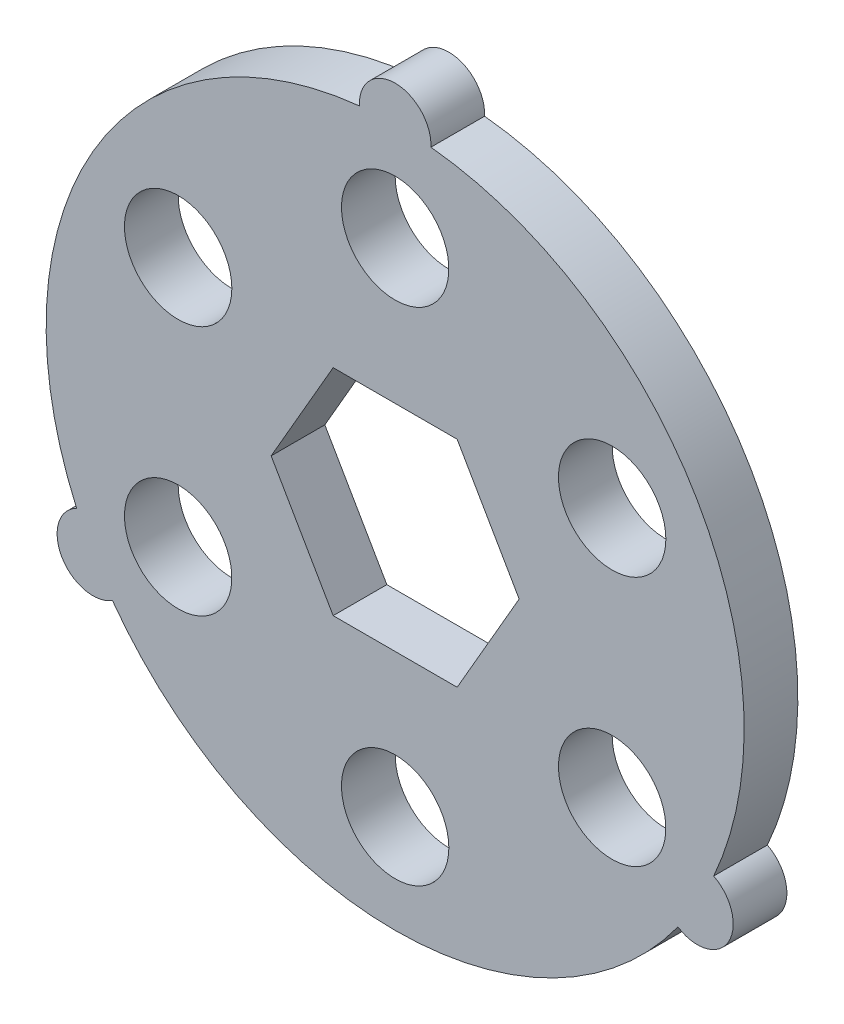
ISO-10303-21;
HEADER;
FILE_DESCRIPTION(('STEP AP214'),'2;1');
FILE_NAME('part.step','',(''),(''),'','','');
FILE_SCHEMA(('AUTOMOTIVE_DESIGN { 1 0 10303 214 1 1 1 1 }'));
ENDSEC;
DATA;
#1=APPLICATION_CONTEXT('core data for automotive mechanical design processes');
#2=APPLICATION_PROTOCOL_DEFINITION('international standard','automotive_design',2000,#1);
#3=PRODUCT_CONTEXT('',#1,'mechanical');
#4=PRODUCT('Part','Part','',(#3));
#5=PRODUCT_RELATED_PRODUCT_CATEGORY('part','',(#4));
#6=PRODUCT_DEFINITION_FORMATION('','',#4);
#7=PRODUCT_DEFINITION_CONTEXT('part definition',#1,'design');
#8=PRODUCT_DEFINITION('design','',#6,#7);
#9=PRODUCT_DEFINITION_SHAPE('','',#8);
#10=(LENGTH_UNIT() NAMED_UNIT(*) SI_UNIT(.MILLI.,.METRE.));
#11=(NAMED_UNIT(*) PLANE_ANGLE_UNIT() SI_UNIT($,.RADIAN.));
#12=(NAMED_UNIT(*) SI_UNIT($,.STERADIAN.) SOLID_ANGLE_UNIT());
#13=UNCERTAINTY_MEASURE_WITH_UNIT(LENGTH_MEASURE(1.E-05),#10,'distance_accuracy_value','');
#14=(GEOMETRIC_REPRESENTATION_CONTEXT(3) GLOBAL_UNCERTAINTY_ASSIGNED_CONTEXT((#13)) GLOBAL_UNIT_ASSIGNED_CONTEXT((#10,
#11,#12)) REPRESENTATION_CONTEXT('',''));
#15=CARTESIAN_POINT('',(0.,0.,0.));
#16=DIRECTION('',(0.,0.,1.));
#17=DIRECTION('',(1.,0.,0.));
#18=AXIS2_PLACEMENT_3D('',#15,#16,#17);
#19=CARTESIAN_POINT('',(0.,0.,0.75));
#20=DIRECTION('',(0.,0.,-1.));
#21=DIRECTION('',(-1.,0.,0.));
#22=AXIS2_PLACEMENT_3D('',#19,#20,#21);
#23=CYLINDRICAL_SURFACE('',#22,9.75);
#24=CARTESIAN_POINT('',(0.,0.,-0.75));
#25=DIRECTION('',(0.,0.,1.));
#26=DIRECTION('',(1.,0.,0.));
#27=AXIS2_PLACEMENT_3D('',#24,#25,#26);
#28=CIRCLE('',#27,9.75);
#29=CARTESIAN_POINT('',(-0.998684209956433,9.69871794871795,-0.75));
#30=VERTEX_POINT('',#29);
#31=CARTESIAN_POINT('',(-8.8986782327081,-3.98447307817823,-0.75));
#32=VERTEX_POINT('',#31);
#33=EDGE_CURVE('E126',#30,#32,#28,.T.);
#34=ORIENTED_EDGE('',*,*,#33,.T.);
#35=DIRECTION('',(0.,0.,1.));
#36=VECTOR('',#35,1.);
#37=CARTESIAN_POINT('',(-8.8986782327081,-3.98447307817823,0.));
#38=LINE('',#37,#36);
#39=CARTESIAN_POINT('',(-8.8986782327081,-3.98447307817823,0.75));
#40=VERTEX_POINT('',#39);
#41=EDGE_CURVE('E51',#32,#40,#38,.T.);
#42=ORIENTED_EDGE('',*,*,#41,.T.);
#43=CARTESIAN_POINT('',(0.,0.,0.75));
#44=DIRECTION('',(0.,0.,1.));
#45=DIRECTION('',(1.,0.,0.));
#46=AXIS2_PLACEMENT_3D('',#43,#44,#45);
#47=CIRCLE('',#46,9.75);
#48=CARTESIAN_POINT('',(-0.998684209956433,9.69871794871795,0.75));
#49=VERTEX_POINT('',#48);
#50=EDGE_CURVE('E233',#49,#40,#47,.T.);
#51=ORIENTED_EDGE('',*,*,#50,.F.);
#52=DIRECTION('',(0.,0.,1.));
#53=VECTOR('',#52,1.);
#54=CARTESIAN_POINT('',(-0.998684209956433,9.69871794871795,0.));
#55=LINE('',#54,#53);
#56=EDGE_CURVE('E235',#49,#30,#55,.F.);
#57=ORIENTED_EDGE('',*,*,#56,.T.);
#58=EDGE_LOOP('',(#34,#42,#51,#57));
#59=FACE_BOUND('',#58,.T.);
#60=ADVANCED_FACE('F29',(#59),#23,.T.);
#61=CARTESIAN_POINT('',(-7.89999402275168,-5.71424487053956,0.75));
#62=VERTEX_POINT('',#61);
#63=CARTESIAN_POINT('',(7.8999940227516,-5.71424487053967,0.75));
#64=VERTEX_POINT('',#63);
#65=EDGE_CURVE('E43',#62,#64,#47,.T.);
#66=ORIENTED_EDGE('',*,*,#65,.F.);
#67=DIRECTION('',(0.,0.,1.));
#68=VECTOR('',#67,1.);
#69=CARTESIAN_POINT('',(-7.89999402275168,-5.71424487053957,0.));
#70=LINE('',#69,#68);
#71=CARTESIAN_POINT('',(-7.89999402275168,-5.71424487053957,-0.75));
#72=VERTEX_POINT('',#71);
#73=EDGE_CURVE('E129',#62,#72,#70,.F.);
#74=ORIENTED_EDGE('',*,*,#73,.T.);
#75=CARTESIAN_POINT('',(7.8999940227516,-5.71424487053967,-0.75));
#76=VERTEX_POINT('',#75);
#77=EDGE_CURVE('E118',#72,#76,#28,.T.);
#78=ORIENTED_EDGE('',*,*,#77,.T.);
#79=DIRECTION('',(0.,0.,1.));
#80=VECTOR('',#79,1.);
#81=CARTESIAN_POINT('',(7.8999940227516,-5.71424487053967,0.));
#82=LINE('',#81,#80);
#83=EDGE_CURVE('E11',#76,#64,#82,.T.);
#84=ORIENTED_EDGE('',*,*,#83,.T.);
#85=EDGE_LOOP('',(#66,#74,#78,#84));
#86=FACE_BOUND('',#85,.T.);
#87=ADVANCED_FACE('F130',(#86),#23,.T.);
#88=CARTESIAN_POINT('',(0.,0.,0.75));
#89=DIRECTION('',(0.,0.,1.));
#90=DIRECTION('',(1.,0.,0.));
#91=AXIS2_PLACEMENT_3D('',#88,#89,#90);
#92=PLANE('',#91);
#93=ORIENTED_EDGE('',*,*,#50,.T.);
#94=CARTESIAN_POINT('',(-8.44374768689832,-4.87499999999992,0.75));
#95=DIRECTION('',(0.,0.,1.));
#96=DIRECTION('',(-0.499999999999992,0.866025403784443,0.));
#97=AXIS2_PLACEMENT_3D('',#94,#95,#96);
#98=CIRCLE('',#97,1.);
#99=EDGE_CURVE('E136',#40,#62,#98,.T.);
#100=ORIENTED_EDGE('',*,*,#99,.T.);
#101=ORIENTED_EDGE('',*,*,#65,.T.);
#102=CARTESIAN_POINT('',(8.44374768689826,-4.87500000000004,0.75));
#103=DIRECTION('',(0.,0.,1.));
#104=DIRECTION('',(-0.500000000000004,-0.866025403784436,0.));
#105=AXIS2_PLACEMENT_3D('',#102,#103,#104);
#106=CIRCLE('',#105,1.);
#107=CARTESIAN_POINT('',(8.89867823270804,-3.98447307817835,0.75));
#108=VERTEX_POINT('',#107);
#109=EDGE_CURVE('E141',#64,#108,#106,.T.);
#110=ORIENTED_EDGE('',*,*,#109,.T.);
#111=CARTESIAN_POINT('',(0.998684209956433,9.69871794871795,0.75));
#112=VERTEX_POINT('',#111);
#113=EDGE_CURVE('E232',#108,#112,#47,.T.);
#114=ORIENTED_EDGE('',*,*,#113,.T.);
#115=CARTESIAN_POINT('',(0.,9.75,0.75));
#116=DIRECTION('',(0.,0.,1.));
#117=DIRECTION('',(1.,0.,0.));
#118=AXIS2_PLACEMENT_3D('',#115,#116,#117);
#119=CIRCLE('',#118,1.);
#120=EDGE_CURVE('E145',#112,#49,#119,.T.);
#121=ORIENTED_EDGE('',*,*,#120,.T.);
#122=EDGE_LOOP('',(#93,#100,#101,#110,#114,#121));
#123=FACE_BOUND('',#122,.T.);
#124=CARTESIAN_POINT('',(0.,7.,0.75));
#125=DIRECTION('',(0.,0.,1.));
#126=DIRECTION('',(0.50000000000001,-0.866025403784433,0.));
#127=AXIS2_PLACEMENT_3D('',#124,#125,#126);
#128=CIRCLE('',#127,1.5);
#129=CARTESIAN_POINT('',(0.749999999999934,5.70096189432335,0.75));
#130=VERTEX_POINT('',#129);
#131=EDGE_CURVE('E151',#130,#130,#128,.T.);
#132=ORIENTED_EDGE('',*,*,#131,.F.);
#133=EDGE_LOOP('',(#132));
#134=FACE_BOUND('',#133,.T.);
#135=CARTESIAN_POINT('',(6.06217782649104,3.50000000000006,0.75));
#136=DIRECTION('',(0.,0.,1.));
#137=DIRECTION('',(-0.499999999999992,-0.866025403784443,0.));
#138=AXIS2_PLACEMENT_3D('',#135,#136,#137);
#139=CIRCLE('',#138,1.5);
#140=CARTESIAN_POINT('',(5.31217782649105,2.20096189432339,0.75));
#141=VERTEX_POINT('',#140);
#142=EDGE_CURVE('E157',#141,#141,#139,.T.);
#143=ORIENTED_EDGE('',*,*,#142,.F.);
#144=EDGE_LOOP('',(#143));
#145=FACE_BOUND('',#144,.T.);
#146=CARTESIAN_POINT('',(6.0621778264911,-3.49999999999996,0.75));
#147=DIRECTION('',(0.,0.,1.));
#148=DIRECTION('',(-1.,0.,0.));
#149=AXIS2_PLACEMENT_3D('',#146,#147,#148);
#150=CIRCLE('',#149,1.5);
#151=CARTESIAN_POINT('',(4.5621778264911,-3.49999999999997,0.75));
#152=VERTEX_POINT('',#151);
#153=EDGE_CURVE('E163',#152,#152,#150,.T.);
#154=ORIENTED_EDGE('',*,*,#153,.F.);
#155=EDGE_LOOP('',(#154));
#156=FACE_BOUND('',#155,.T.);
#157=CARTESIAN_POINT('',(0.,-7.,0.75));
#158=DIRECTION('',(0.,0.,1.));
#159=DIRECTION('',(-0.500000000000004,0.866025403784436,0.));
#160=AXIS2_PLACEMENT_3D('',#157,#158,#159);
#161=CIRCLE('',#160,1.5);
#162=CARTESIAN_POINT('',(-0.749999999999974,-5.70096189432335,0.75));
#163=VERTEX_POINT('',#162);
#164=EDGE_CURVE('E169',#163,#163,#161,.T.);
#165=ORIENTED_EDGE('',*,*,#164,.F.);
#166=EDGE_LOOP('',(#165));
#167=FACE_BOUND('',#166,.T.);
#168=CARTESIAN_POINT('',(-6.06217782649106,-3.50000000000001,0.75));
#169=DIRECTION('',(0.,0.,1.));
#170=DIRECTION('',(0.499999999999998,0.86602540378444,0.));
#171=AXIS2_PLACEMENT_3D('',#168,#169,#170);
#172=CIRCLE('',#171,1.5);
#173=CARTESIAN_POINT('',(-5.31217782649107,-2.20096189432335,0.75));
#174=VERTEX_POINT('',#173);
#175=EDGE_CURVE('E175',#174,#174,#172,.T.);
#176=ORIENTED_EDGE('',*,*,#175,.F.);
#177=EDGE_LOOP('',(#176));
#178=FACE_BOUND('',#177,.T.);
#179=CARTESIAN_POINT('',(-6.06217782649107,3.5,0.75));
#180=DIRECTION('',(0.,0.,1.));
#181=DIRECTION('',(1.,0.,0.));
#182=AXIS2_PLACEMENT_3D('',#179,#180,#181);
#183=CIRCLE('',#182,1.5);
#184=CARTESIAN_POINT('',(-4.56217782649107,3.5,0.75));
#185=VERTEX_POINT('',#184);
#186=EDGE_CURVE('E181',#185,#185,#183,.T.);
#187=ORIENTED_EDGE('',*,*,#186,.F.);
#188=EDGE_LOOP('',(#187));
#189=FACE_BOUND('',#188,.T.);
#190=DIRECTION('',(-0.5,0.866025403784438,0.));
#191=VECTOR('',#190,1.);
#192=CARTESIAN_POINT('',(3.46410161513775,0.,0.75));
#193=LINE('',#192,#191);
#194=CARTESIAN_POINT('',(3.46410161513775,0.,0.75));
#195=VERTEX_POINT('',#194);
#196=CARTESIAN_POINT('',(1.73205080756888,3.,0.75));
#197=VERTEX_POINT('',#196);
#198=EDGE_CURVE('E207',#195,#197,#193,.T.);
#199=ORIENTED_EDGE('',*,*,#198,.F.);
#200=DIRECTION('',(0.5,0.866025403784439,0.));
#201=VECTOR('',#200,1.);
#202=CARTESIAN_POINT('',(1.73205080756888,-3.,0.75));
#203=LINE('',#202,#201);
#204=CARTESIAN_POINT('',(1.73205080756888,-3.,0.75));
#205=VERTEX_POINT('',#204);
#206=EDGE_CURVE('E205',#205,#195,#203,.T.);
#207=ORIENTED_EDGE('',*,*,#206,.F.);
#208=DIRECTION('',(1.,0.,0.));
#209=VECTOR('',#208,1.);
#210=CARTESIAN_POINT('',(-1.73205080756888,-3.,0.75));
#211=LINE('',#210,#209);
#212=CARTESIAN_POINT('',(-1.73205080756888,-3.,0.75));
#213=VERTEX_POINT('',#212);
#214=EDGE_CURVE('E216',#213,#205,#211,.T.);
#215=ORIENTED_EDGE('',*,*,#214,.F.);
#216=DIRECTION('',(0.5,-0.866025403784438,0.));
#217=VECTOR('',#216,1.);
#218=CARTESIAN_POINT('',(-3.46410161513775,0.,0.75));
#219=LINE('',#218,#217);
#220=CARTESIAN_POINT('',(-3.46410161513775,0.,0.75));
#221=VERTEX_POINT('',#220);
#222=EDGE_CURVE('E213',#221,#213,#219,.T.);
#223=ORIENTED_EDGE('',*,*,#222,.F.);
#224=DIRECTION('',(-0.5,-0.866025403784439,0.));
#225=VECTOR('',#224,1.);
#226=CARTESIAN_POINT('',(-1.73205080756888,3.,0.75));
#227=LINE('',#226,#225);
#228=CARTESIAN_POINT('',(-1.73205080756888,3.,0.75));
#229=VERTEX_POINT('',#228);
#230=EDGE_CURVE('E211',#229,#221,#227,.T.);
#231=ORIENTED_EDGE('',*,*,#230,.F.);
#232=DIRECTION('',(-1.,0.,0.));
#233=VECTOR('',#232,1.);
#234=CARTESIAN_POINT('',(1.73205080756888,3.,0.75));
#235=LINE('',#234,#233);
#236=EDGE_CURVE('E209',#197,#229,#235,.T.);
#237=ORIENTED_EDGE('',*,*,#236,.F.);
#238=EDGE_LOOP('',(#199,#207,#215,#223,#231,#237));
#239=FACE_BOUND('',#238,.T.);
#240=ADVANCED_FACE('F248',(#123,#134,#145,#156,#167,#178,#189,#239),#92,.T.);
#241=CARTESIAN_POINT('',(0.,0.,-0.75));
#242=DIRECTION('',(0.,0.,1.));
#243=DIRECTION('',(1.,0.,0.));
#244=AXIS2_PLACEMENT_3D('',#241,#242,#243);
#245=PLANE('',#244);
#246=CARTESIAN_POINT('',(0.,7.,-0.75));
#247=DIRECTION('',(0.,0.,1.));
#248=DIRECTION('',(0.50000000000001,-0.866025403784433,0.));
#249=AXIS2_PLACEMENT_3D('',#246,#247,#248);
#250=CIRCLE('',#249,1.5);
#251=CARTESIAN_POINT('',(0.749999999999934,5.70096189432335,-0.75));
#252=VERTEX_POINT('',#251);
#253=EDGE_CURVE('E154',#252,#252,#250,.T.);
#254=ORIENTED_EDGE('',*,*,#253,.T.);
#255=EDGE_LOOP('',(#254));
#256=FACE_BOUND('',#255,.T.);
#257=CARTESIAN_POINT('',(6.06217782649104,3.50000000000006,-0.75));
#258=DIRECTION('',(0.,0.,1.));
#259=DIRECTION('',(-0.499999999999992,-0.866025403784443,0.));
#260=AXIS2_PLACEMENT_3D('',#257,#258,#259);
#261=CIRCLE('',#260,1.5);
#262=CARTESIAN_POINT('',(5.31217782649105,2.20096189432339,-0.75));
#263=VERTEX_POINT('',#262);
#264=EDGE_CURVE('E160',#263,#263,#261,.T.);
#265=ORIENTED_EDGE('',*,*,#264,.T.);
#266=EDGE_LOOP('',(#265));
#267=FACE_BOUND('',#266,.T.);
#268=CARTESIAN_POINT('',(6.0621778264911,-3.49999999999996,-0.75));
#269=DIRECTION('',(0.,0.,1.));
#270=DIRECTION('',(-1.,0.,0.));
#271=AXIS2_PLACEMENT_3D('',#268,#269,#270);
#272=CIRCLE('',#271,1.5);
#273=CARTESIAN_POINT('',(4.5621778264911,-3.49999999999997,-0.75));
#274=VERTEX_POINT('',#273);
#275=EDGE_CURVE('E166',#274,#274,#272,.T.);
#276=ORIENTED_EDGE('',*,*,#275,.T.);
#277=EDGE_LOOP('',(#276));
#278=FACE_BOUND('',#277,.T.);
#279=CARTESIAN_POINT('',(0.,-7.,-0.75));
#280=DIRECTION('',(0.,0.,1.));
#281=DIRECTION('',(-0.500000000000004,0.866025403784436,0.));
#282=AXIS2_PLACEMENT_3D('',#279,#280,#281);
#283=CIRCLE('',#282,1.5);
#284=CARTESIAN_POINT('',(-0.749999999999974,-5.70096189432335,-0.75));
#285=VERTEX_POINT('',#284);
#286=EDGE_CURVE('E172',#285,#285,#283,.T.);
#287=ORIENTED_EDGE('',*,*,#286,.T.);
#288=EDGE_LOOP('',(#287));
#289=FACE_BOUND('',#288,.T.);
#290=CARTESIAN_POINT('',(-6.06217782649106,-3.50000000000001,-0.75));
#291=DIRECTION('',(0.,0.,1.));
#292=DIRECTION('',(0.499999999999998,0.86602540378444,0.));
#293=AXIS2_PLACEMENT_3D('',#290,#291,#292);
#294=CIRCLE('',#293,1.5);
#295=CARTESIAN_POINT('',(-5.31217782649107,-2.20096189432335,-0.75));
#296=VERTEX_POINT('',#295);
#297=EDGE_CURVE('E178',#296,#296,#294,.T.);
#298=ORIENTED_EDGE('',*,*,#297,.T.);
#299=EDGE_LOOP('',(#298));
#300=FACE_BOUND('',#299,.T.);
#301=CARTESIAN_POINT('',(-6.06217782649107,3.5,-0.75));
#302=DIRECTION('',(0.,0.,1.));
#303=DIRECTION('',(1.,0.,0.));
#304=AXIS2_PLACEMENT_3D('',#301,#302,#303);
#305=CIRCLE('',#304,1.5);
#306=CARTESIAN_POINT('',(-4.56217782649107,3.5,-0.75));
#307=VERTEX_POINT('',#306);
#308=EDGE_CURVE('E184',#307,#307,#305,.T.);
#309=ORIENTED_EDGE('',*,*,#308,.T.);
#310=EDGE_LOOP('',(#309));
#311=FACE_BOUND('',#310,.T.);
#312=ORIENTED_EDGE('',*,*,#77,.F.);
#313=CARTESIAN_POINT('',(-8.44374768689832,-4.87499999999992,-0.75));
#314=DIRECTION('',(0.,0.,1.));
#315=DIRECTION('',(1.,0.,0.));
#316=AXIS2_PLACEMENT_3D('',#313,#314,#315);
#317=CIRCLE('',#316,1.);
#318=EDGE_CURVE('E122',#72,#32,#317,.F.);
#319=ORIENTED_EDGE('',*,*,#318,.T.);
#320=ORIENTED_EDGE('',*,*,#33,.F.);
#321=CARTESIAN_POINT('',(0.,9.75,-0.75));
#322=DIRECTION('',(0.,0.,1.));
#323=DIRECTION('',(1.,0.,0.));
#324=AXIS2_PLACEMENT_3D('',#321,#322,#323);
#325=CIRCLE('',#324,1.);
#326=CARTESIAN_POINT('',(0.998684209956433,9.69871794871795,-0.75));
#327=VERTEX_POINT('',#326);
#328=EDGE_CURVE('E148',#30,#327,#325,.F.);
#329=ORIENTED_EDGE('',*,*,#328,.T.);
#330=CARTESIAN_POINT('',(8.89867823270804,-3.98447307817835,-0.75));
#331=VERTEX_POINT('',#330);
#332=EDGE_CURVE('E127',#331,#327,#28,.T.);
#333=ORIENTED_EDGE('',*,*,#332,.F.);
#334=CARTESIAN_POINT('',(8.44374768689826,-4.87500000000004,-0.75));
#335=DIRECTION('',(0.,0.,1.));
#336=DIRECTION('',(1.,0.,0.));
#337=AXIS2_PLACEMENT_3D('',#334,#335,#336);
#338=CIRCLE('',#337,1.);
#339=EDGE_CURVE('E124',#331,#76,#338,.F.);
#340=ORIENTED_EDGE('',*,*,#339,.T.);
#341=EDGE_LOOP('',(#312,#319,#320,#329,#333,#340));
#342=FACE_BOUND('',#341,.T.);
#343=DIRECTION('',(0.5,0.866025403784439,0.));
#344=VECTOR('',#343,1.);
#345=CARTESIAN_POINT('',(1.73205080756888,-3.,-0.75));
#346=LINE('',#345,#344);
#347=CARTESIAN_POINT('',(1.73205080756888,-3.,-0.75));
#348=VERTEX_POINT('',#347);
#349=CARTESIAN_POINT('',(3.46410161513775,0.,-0.75));
#350=VERTEX_POINT('',#349);
#351=EDGE_CURVE('E187',#348,#350,#346,.T.);
#352=ORIENTED_EDGE('',*,*,#351,.T.);
#353=DIRECTION('',(-0.5,0.866025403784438,0.));
#354=VECTOR('',#353,1.);
#355=CARTESIAN_POINT('',(3.46410161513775,0.,-0.75));
#356=LINE('',#355,#354);
#357=CARTESIAN_POINT('',(1.73205080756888,3.,-0.75));
#358=VERTEX_POINT('',#357);
#359=EDGE_CURVE('E190',#350,#358,#356,.T.);
#360=ORIENTED_EDGE('',*,*,#359,.T.);
#361=DIRECTION('',(-1.,0.,0.));
#362=VECTOR('',#361,1.);
#363=CARTESIAN_POINT('',(1.73205080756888,3.,-0.75));
#364=LINE('',#363,#362);
#365=CARTESIAN_POINT('',(-1.73205080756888,3.,-0.75));
#366=VERTEX_POINT('',#365);
#367=EDGE_CURVE('E193',#358,#366,#364,.T.);
#368=ORIENTED_EDGE('',*,*,#367,.T.);
#369=DIRECTION('',(-0.5,-0.866025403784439,0.));
#370=VECTOR('',#369,1.);
#371=CARTESIAN_POINT('',(-1.73205080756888,3.,-0.75));
#372=LINE('',#371,#370);
#373=CARTESIAN_POINT('',(-3.46410161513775,0.,-0.75));
#374=VERTEX_POINT('',#373);
#375=EDGE_CURVE('E196',#366,#374,#372,.T.);
#376=ORIENTED_EDGE('',*,*,#375,.T.);
#377=DIRECTION('',(0.5,-0.866025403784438,0.));
#378=VECTOR('',#377,1.);
#379=CARTESIAN_POINT('',(-3.46410161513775,0.,-0.75));
#380=LINE('',#379,#378);
#381=CARTESIAN_POINT('',(-1.73205080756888,-3.,-0.75));
#382=VERTEX_POINT('',#381);
#383=EDGE_CURVE('E199',#374,#382,#380,.T.);
#384=ORIENTED_EDGE('',*,*,#383,.T.);
#385=DIRECTION('',(1.,0.,0.));
#386=VECTOR('',#385,1.);
#387=CARTESIAN_POINT('',(-1.73205080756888,-3.,-0.75));
#388=LINE('',#387,#386);
#389=EDGE_CURVE('E202',#382,#348,#388,.T.);
#390=ORIENTED_EDGE('',*,*,#389,.T.);
#391=EDGE_LOOP('',(#352,#360,#368,#376,#384,#390));
#392=FACE_BOUND('',#391,.T.);
#393=ADVANCED_FACE('F119',(#256,#267,#278,#289,#300,#311,#342,#392),#245,.F.);
#394=ORIENTED_EDGE('',*,*,#113,.F.);
#395=DIRECTION('',(0.,0.,1.));
#396=VECTOR('',#395,1.);
#397=CARTESIAN_POINT('',(8.89867823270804,-3.98447307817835,0.));
#398=LINE('',#397,#396);
#399=EDGE_CURVE('E37',#108,#331,#398,.F.);
#400=ORIENTED_EDGE('',*,*,#399,.T.);
#401=ORIENTED_EDGE('',*,*,#332,.T.);
#402=DIRECTION('',(0.,0.,1.));
#403=VECTOR('',#402,1.);
#404=CARTESIAN_POINT('',(0.998684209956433,9.69871794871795,0.));
#405=LINE('',#404,#403);
#406=EDGE_CURVE('E238',#327,#112,#405,.T.);
#407=ORIENTED_EDGE('',*,*,#406,.T.);
#408=EDGE_LOOP('',(#394,#400,#401,#407));
#409=FACE_BOUND('',#408,.T.);
#410=ADVANCED_FACE('F31',(#409),#23,.T.);
#411=CARTESIAN_POINT('',(1.73205080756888,-3.,0.75));
#412=DIRECTION('',(-0.866025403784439,0.5,0.));
#413=DIRECTION('',(-0.5,-0.866025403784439,0.));
#414=AXIS2_PLACEMENT_3D('',#411,#412,#413);
#415=PLANE('',#414);
#416=ORIENTED_EDGE('',*,*,#351,.F.);
#417=DIRECTION('',(0.,0.,-1.));
#418=VECTOR('',#417,1.);
#419=CARTESIAN_POINT('',(1.73205080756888,-3.,0.75));
#420=LINE('',#419,#418);
#421=EDGE_CURVE('E218',#205,#348,#420,.T.);
#422=ORIENTED_EDGE('',*,*,#421,.F.);
#423=ORIENTED_EDGE('',*,*,#206,.T.);
#424=DIRECTION('',(0.,0.,-1.));
#425=VECTOR('',#424,1.);
#426=CARTESIAN_POINT('',(3.46410161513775,0.,0.75));
#427=LINE('',#426,#425);
#428=EDGE_CURVE('E229',#195,#350,#427,.T.);
#429=ORIENTED_EDGE('',*,*,#428,.T.);
#430=EDGE_LOOP('',(#416,#422,#423,#429));
#431=FACE_BOUND('',#430,.T.);
#432=ADVANCED_FACE('F271',(#431),#415,.T.);
#433=CARTESIAN_POINT('',(3.46410161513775,0.,0.75));
#434=DIRECTION('',(-0.866025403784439,-0.5,0.));
#435=DIRECTION('',(0.5,-0.866025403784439,0.));
#436=AXIS2_PLACEMENT_3D('',#433,#434,#435);
#437=PLANE('',#436);
#438=ORIENTED_EDGE('',*,*,#359,.F.);
#439=ORIENTED_EDGE('',*,*,#428,.F.);
#440=ORIENTED_EDGE('',*,*,#198,.T.);
#441=DIRECTION('',(0.,0.,-1.));
#442=VECTOR('',#441,1.);
#443=CARTESIAN_POINT('',(1.73205080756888,3.,0.75));
#444=LINE('',#443,#442);
#445=EDGE_CURVE('E227',#197,#358,#444,.T.);
#446=ORIENTED_EDGE('',*,*,#445,.T.);
#447=EDGE_LOOP('',(#438,#439,#440,#446));
#448=FACE_BOUND('',#447,.T.);
#449=ADVANCED_FACE('F276',(#448),#437,.T.);
#450=CARTESIAN_POINT('',(1.73205080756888,3.,0.75));
#451=DIRECTION('',(0.,-1.,0.));
#452=DIRECTION('',(1.,0.,0.));
#453=AXIS2_PLACEMENT_3D('',#450,#451,#452);
#454=PLANE('',#453);
#455=ORIENTED_EDGE('',*,*,#367,.F.);
#456=ORIENTED_EDGE('',*,*,#445,.F.);
#457=ORIENTED_EDGE('',*,*,#236,.T.);
#458=DIRECTION('',(0.,0.,-1.));
#459=VECTOR('',#458,1.);
#460=CARTESIAN_POINT('',(-1.73205080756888,3.,0.75));
#461=LINE('',#460,#459);
#462=EDGE_CURVE('E225',#229,#366,#461,.T.);
#463=ORIENTED_EDGE('',*,*,#462,.T.);
#464=EDGE_LOOP('',(#455,#456,#457,#463));
#465=FACE_BOUND('',#464,.T.);
#466=ADVANCED_FACE('F288',(#465),#454,.T.);
#467=CARTESIAN_POINT('',(-1.73205080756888,3.,0.75));
#468=DIRECTION('',(0.866025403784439,-0.5,0.));
#469=DIRECTION('',(0.5,0.866025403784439,0.));
#470=AXIS2_PLACEMENT_3D('',#467,#468,#469);
#471=PLANE('',#470);
#472=ORIENTED_EDGE('',*,*,#375,.F.);
#473=ORIENTED_EDGE('',*,*,#462,.F.);
#474=ORIENTED_EDGE('',*,*,#230,.T.);
#475=DIRECTION('',(0.,0.,-1.));
#476=VECTOR('',#475,1.);
#477=CARTESIAN_POINT('',(-3.46410161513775,0.,0.75));
#478=LINE('',#477,#476);
#479=EDGE_CURVE('E223',#221,#374,#478,.T.);
#480=ORIENTED_EDGE('',*,*,#479,.T.);
#481=EDGE_LOOP('',(#472,#473,#474,#480));
#482=FACE_BOUND('',#481,.T.);
#483=ADVANCED_FACE('F292',(#482),#471,.T.);
#484=CARTESIAN_POINT('',(-3.46410161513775,0.,0.75));
#485=DIRECTION('',(0.866025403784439,0.5,0.));
#486=DIRECTION('',(-0.5,0.866025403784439,0.));
#487=AXIS2_PLACEMENT_3D('',#484,#485,#486);
#488=PLANE('',#487);
#489=ORIENTED_EDGE('',*,*,#383,.F.);
#490=ORIENTED_EDGE('',*,*,#479,.F.);
#491=ORIENTED_EDGE('',*,*,#222,.T.);
#492=DIRECTION('',(0.,0.,-1.));
#493=VECTOR('',#492,1.);
#494=CARTESIAN_POINT('',(-1.73205080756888,-3.,0.75));
#495=LINE('',#494,#493);
#496=EDGE_CURVE('E221',#213,#382,#495,.T.);
#497=ORIENTED_EDGE('',*,*,#496,.T.);
#498=EDGE_LOOP('',(#489,#490,#491,#497));
#499=FACE_BOUND('',#498,.T.);
#500=ADVANCED_FACE('F296',(#499),#488,.T.);
#501=CARTESIAN_POINT('',(-1.73205080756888,-3.,0.75));
#502=DIRECTION('',(0.,1.,0.));
#503=DIRECTION('',(-1.,0.,0.));
#504=AXIS2_PLACEMENT_3D('',#501,#502,#503);
#505=PLANE('',#504);
#506=ORIENTED_EDGE('',*,*,#389,.F.);
#507=ORIENTED_EDGE('',*,*,#496,.F.);
#508=ORIENTED_EDGE('',*,*,#214,.T.);
#509=ORIENTED_EDGE('',*,*,#421,.T.);
#510=EDGE_LOOP('',(#506,#507,#508,#509));
#511=FACE_BOUND('',#510,.T.);
#512=ADVANCED_FACE('F300',(#511),#505,.T.);
#513=CARTESIAN_POINT('',(-6.06217782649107,3.5,-0.75));
#514=DIRECTION('',(0.,0.,1.));
#515=DIRECTION('',(1.,0.,0.));
#516=AXIS2_PLACEMENT_3D('',#513,#514,#515);
#517=CYLINDRICAL_SURFACE('',#516,1.5);
#518=ORIENTED_EDGE('',*,*,#308,.F.);
#519=EDGE_LOOP('',(#518));
#520=FACE_BOUND('',#519,.T.);
#521=ORIENTED_EDGE('',*,*,#186,.T.);
#522=EDGE_LOOP('',(#521));
#523=FACE_BOUND('',#522,.T.);
#524=ADVANCED_FACE('F304',(#520,#523),#517,.F.);
#525=CARTESIAN_POINT('',(-6.06217782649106,-3.50000000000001,-0.75));
#526=DIRECTION('',(0.,0.,1.));
#527=DIRECTION('',(1.,0.,0.));
#528=AXIS2_PLACEMENT_3D('',#525,#526,#527);
#529=CYLINDRICAL_SURFACE('',#528,1.5);
#530=ORIENTED_EDGE('',*,*,#297,.F.);
#531=EDGE_LOOP('',(#530));
#532=FACE_BOUND('',#531,.T.);
#533=ORIENTED_EDGE('',*,*,#175,.T.);
#534=EDGE_LOOP('',(#533));
#535=FACE_BOUND('',#534,.T.);
#536=ADVANCED_FACE('F308',(#532,#535),#529,.F.);
#537=CARTESIAN_POINT('',(0.,-7.,-0.75));
#538=DIRECTION('',(0.,0.,1.));
#539=DIRECTION('',(1.,0.,0.));
#540=AXIS2_PLACEMENT_3D('',#537,#538,#539);
#541=CYLINDRICAL_SURFACE('',#540,1.5);
#542=ORIENTED_EDGE('',*,*,#286,.F.);
#543=EDGE_LOOP('',(#542));
#544=FACE_BOUND('',#543,.T.);
#545=ORIENTED_EDGE('',*,*,#164,.T.);
#546=EDGE_LOOP('',(#545));
#547=FACE_BOUND('',#546,.T.);
#548=ADVANCED_FACE('F312',(#544,#547),#541,.F.);
#549=CARTESIAN_POINT('',(6.0621778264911,-3.49999999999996,-0.75));
#550=DIRECTION('',(0.,0.,1.));
#551=DIRECTION('',(1.,0.,0.));
#552=AXIS2_PLACEMENT_3D('',#549,#550,#551);
#553=CYLINDRICAL_SURFACE('',#552,1.5);
#554=ORIENTED_EDGE('',*,*,#275,.F.);
#555=EDGE_LOOP('',(#554));
#556=FACE_BOUND('',#555,.T.);
#557=ORIENTED_EDGE('',*,*,#153,.T.);
#558=EDGE_LOOP('',(#557));
#559=FACE_BOUND('',#558,.T.);
#560=ADVANCED_FACE('F316',(#556,#559),#553,.F.);
#561=CARTESIAN_POINT('',(6.06217782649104,3.50000000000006,-0.75));
#562=DIRECTION('',(0.,0.,1.));
#563=DIRECTION('',(1.,0.,0.));
#564=AXIS2_PLACEMENT_3D('',#561,#562,#563);
#565=CYLINDRICAL_SURFACE('',#564,1.5);
#566=ORIENTED_EDGE('',*,*,#264,.F.);
#567=EDGE_LOOP('',(#566));
#568=FACE_BOUND('',#567,.T.);
#569=ORIENTED_EDGE('',*,*,#142,.T.);
#570=EDGE_LOOP('',(#569));
#571=FACE_BOUND('',#570,.T.);
#572=ADVANCED_FACE('F263',(#568,#571),#565,.F.);
#573=CARTESIAN_POINT('',(0.,7.,-0.75));
#574=DIRECTION('',(0.,0.,1.));
#575=DIRECTION('',(1.,0.,0.));
#576=AXIS2_PLACEMENT_3D('',#573,#574,#575);
#577=CYLINDRICAL_SURFACE('',#576,1.5);
#578=ORIENTED_EDGE('',*,*,#253,.F.);
#579=EDGE_LOOP('',(#578));
#580=FACE_BOUND('',#579,.T.);
#581=ORIENTED_EDGE('',*,*,#131,.T.);
#582=EDGE_LOOP('',(#581));
#583=FACE_BOUND('',#582,.T.);
#584=ADVANCED_FACE('F256',(#580,#583),#577,.F.);
#585=CARTESIAN_POINT('',(0.,9.75,-3.57842712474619));
#586=DIRECTION('',(0.,0.,1.));
#587=DIRECTION('',(1.,0.,0.));
#588=AXIS2_PLACEMENT_3D('',#585,#586,#587);
#589=CYLINDRICAL_SURFACE('',#588,1.);
#590=ORIENTED_EDGE('',*,*,#406,.F.);
#591=ORIENTED_EDGE('',*,*,#328,.F.);
#592=ORIENTED_EDGE('',*,*,#56,.F.);
#593=ORIENTED_EDGE('',*,*,#120,.F.);
#594=EDGE_LOOP('',(#590,#591,#592,#593));
#595=FACE_BOUND('',#594,.T.);
#596=ADVANCED_FACE('F254',(#595),#589,.T.);
#597=CARTESIAN_POINT('',(8.44374768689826,-4.87500000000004,-3.57842712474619));
#598=DIRECTION('',(0.,0.,1.));
#599=DIRECTION('',(1.,0.,0.));
#600=AXIS2_PLACEMENT_3D('',#597,#598,#599);
#601=CYLINDRICAL_SURFACE('',#600,1.);
#602=ORIENTED_EDGE('',*,*,#83,.F.);
#603=ORIENTED_EDGE('',*,*,#339,.F.);
#604=ORIENTED_EDGE('',*,*,#399,.F.);
#605=ORIENTED_EDGE('',*,*,#109,.F.);
#606=EDGE_LOOP('',(#602,#603,#604,#605));
#607=FACE_BOUND('',#606,.T.);
#608=ADVANCED_FACE('F246',(#607),#601,.T.);
#609=CARTESIAN_POINT('',(-8.44374768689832,-4.87499999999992,-3.57842712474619));
#610=DIRECTION('',(0.,0.,1.));
#611=DIRECTION('',(1.,0.,0.));
#612=AXIS2_PLACEMENT_3D('',#609,#610,#611);
#613=CYLINDRICAL_SURFACE('',#612,1.);
#614=ORIENTED_EDGE('',*,*,#41,.F.);
#615=ORIENTED_EDGE('',*,*,#318,.F.);
#616=ORIENTED_EDGE('',*,*,#73,.F.);
#617=ORIENTED_EDGE('',*,*,#99,.F.);
#618=EDGE_LOOP('',(#614,#615,#616,#617));
#619=FACE_BOUND('',#618,.T.);
#620=ADVANCED_FACE('F135',(#619),#613,.T.);
#621=CLOSED_SHELL('',(#60,#87,#240,#393,#410,#432,#449,#466,#483,#500,#512,#524,#536,#548,#560,
#572,#584,#596,#608,#620));
#622=MANIFOLD_SOLID_BREP('B2',#621);
#623=ADVANCED_BREP_SHAPE_REPRESENTATION('',(#18,#622),#14);
#624=SHAPE_DEFINITION_REPRESENTATION(#9,#623);
ENDSEC;
END-ISO-10303-21;
